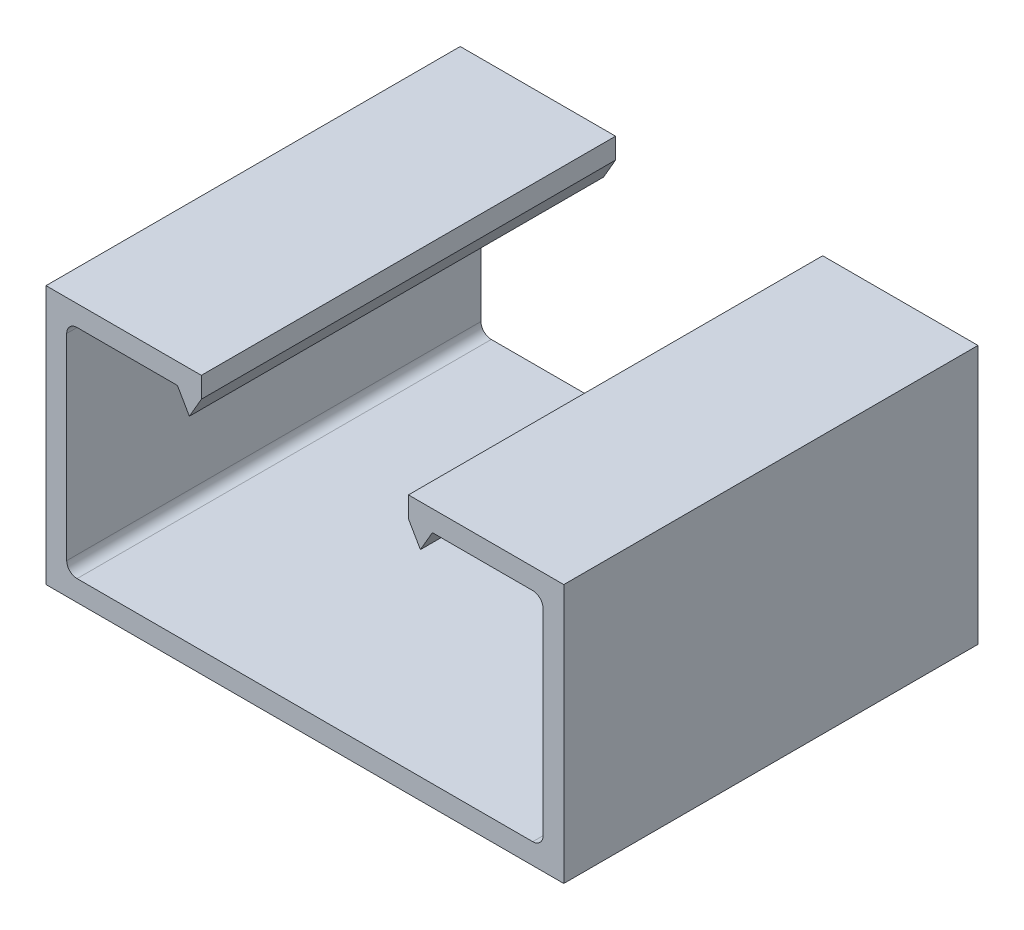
ISO-10303-21;
HEADER;
FILE_DESCRIPTION(('STEP AP214'),'2;1');
FILE_NAME('part.step','',(''),(''),'','','');
FILE_SCHEMA(('AUTOMOTIVE_DESIGN { 1 0 10303 214 1 1 1 1 }'));
ENDSEC;
DATA;
#1=APPLICATION_CONTEXT('core data for automotive mechanical design processes');
#2=APPLICATION_PROTOCOL_DEFINITION('international standard','automotive_design',2000,#1);
#3=PRODUCT_CONTEXT('',#1,'mechanical');
#4=PRODUCT('Part','Part','',(#3));
#5=PRODUCT_RELATED_PRODUCT_CATEGORY('part','',(#4));
#6=PRODUCT_DEFINITION_FORMATION('','',#4);
#7=PRODUCT_DEFINITION_CONTEXT('part definition',#1,'design');
#8=PRODUCT_DEFINITION('design','',#6,#7);
#9=PRODUCT_DEFINITION_SHAPE('','',#8);
#10=(LENGTH_UNIT() NAMED_UNIT(*) SI_UNIT(.MILLI.,.METRE.));
#11=(NAMED_UNIT(*) PLANE_ANGLE_UNIT() SI_UNIT($,.RADIAN.));
#12=(NAMED_UNIT(*) SI_UNIT($,.STERADIAN.) SOLID_ANGLE_UNIT());
#13=UNCERTAINTY_MEASURE_WITH_UNIT(LENGTH_MEASURE(1.E-05),#10,'distance_accuracy_value','');
#14=(GEOMETRIC_REPRESENTATION_CONTEXT(3) GLOBAL_UNCERTAINTY_ASSIGNED_CONTEXT((#13)) GLOBAL_UNIT_ASSIGNED_CONTEXT((#10,
#11,#12)) REPRESENTATION_CONTEXT('',''));
#15=CARTESIAN_POINT('',(0.,0.,0.));
#16=DIRECTION('',(0.,0.,1.));
#17=DIRECTION('',(1.,0.,0.));
#18=AXIS2_PLACEMENT_3D('',#15,#16,#17);
#19=CARTESIAN_POINT('',(-13.97,-6.0325,12.7));
#20=DIRECTION('',(0.,0.,-1.));
#21=DIRECTION('',(-1.,0.,0.));
#22=AXIS2_PLACEMENT_3D('',#19,#20,#21);
#23=CYLINDRICAL_SURFACE('',#22,0.635);
#24=CARTESIAN_POINT('',(-13.97,-6.0325,-12.7));
#25=DIRECTION('',(0.,0.,-1.));
#26=DIRECTION('',(1.,0.,0.));
#27=AXIS2_PLACEMENT_3D('',#24,#25,#26);
#28=CIRCLE('',#27,0.635);
#29=CARTESIAN_POINT('',(-13.97,-6.6675,-12.7));
#30=VERTEX_POINT('',#29);
#31=CARTESIAN_POINT('',(-14.605,-6.0325,-12.7));
#32=VERTEX_POINT('',#31);
#33=EDGE_CURVE('E207',#30,#32,#28,.T.);
#34=ORIENTED_EDGE('',*,*,#33,.T.);
#35=DIRECTION('',(0.,0.,-1.));
#36=VECTOR('',#35,1.);
#37=CARTESIAN_POINT('',(-14.605,-6.0325,12.7));
#38=LINE('',#37,#36);
#39=CARTESIAN_POINT('',(-14.605,-6.0325,12.7));
#40=VERTEX_POINT('',#39);
#41=EDGE_CURVE('E11',#40,#32,#38,.T.);
#42=ORIENTED_EDGE('',*,*,#41,.F.);
#43=CARTESIAN_POINT('',(-13.97,-6.0325,12.7));
#44=DIRECTION('',(0.,0.,-1.));
#45=DIRECTION('',(1.,0.,0.));
#46=AXIS2_PLACEMENT_3D('',#43,#44,#45);
#47=CIRCLE('',#46,0.635);
#48=CARTESIAN_POINT('',(-13.97,-6.6675,12.7));
#49=VERTEX_POINT('',#48);
#50=EDGE_CURVE('E245',#49,#40,#47,.T.);
#51=ORIENTED_EDGE('',*,*,#50,.F.);
#52=DIRECTION('',(0.,0.,-1.));
#53=VECTOR('',#52,1.);
#54=CARTESIAN_POINT('',(-13.97,-6.6675,12.7));
#55=LINE('',#54,#53);
#56=EDGE_CURVE('E203',#49,#30,#55,.T.);
#57=ORIENTED_EDGE('',*,*,#56,.T.);
#58=EDGE_LOOP('',(#34,#42,#51,#57));
#59=FACE_BOUND('',#58,.T.);
#60=ADVANCED_FACE('F39',(#59),#23,.F.);
#61=CARTESIAN_POINT('',(-14.605,6.0325,12.7));
#62=DIRECTION('',(-1.,0.,0.));
#63=DIRECTION('',(0.,-1.,0.));
#64=AXIS2_PLACEMENT_3D('',#61,#62,#63);
#65=PLANE('',#64);
#66=DIRECTION('',(0.,1.,0.));
#67=VECTOR('',#66,1.);
#68=CARTESIAN_POINT('',(-14.605,6.0325,-12.7));
#69=LINE('',#68,#67);
#70=CARTESIAN_POINT('',(-14.605,6.0325,-12.7));
#71=VERTEX_POINT('',#70);
#72=EDGE_CURVE('E210',#32,#71,#69,.T.);
#73=ORIENTED_EDGE('',*,*,#72,.T.);
#74=DIRECTION('',(0.,0.,-1.));
#75=VECTOR('',#74,1.);
#76=CARTESIAN_POINT('',(-14.605,6.0325,12.7));
#77=LINE('',#76,#75);
#78=CARTESIAN_POINT('',(-14.605,6.0325,12.7));
#79=VERTEX_POINT('',#78);
#80=EDGE_CURVE('E47',#79,#71,#77,.T.);
#81=ORIENTED_EDGE('',*,*,#80,.F.);
#82=DIRECTION('',(0.,1.,0.));
#83=VECTOR('',#82,1.);
#84=CARTESIAN_POINT('',(-14.605,6.0325,12.7));
#85=LINE('',#84,#83);
#86=EDGE_CURVE('E134',#40,#79,#85,.T.);
#87=ORIENTED_EDGE('',*,*,#86,.F.);
#88=ORIENTED_EDGE('',*,*,#41,.T.);
#89=EDGE_LOOP('',(#73,#81,#87,#88));
#90=FACE_BOUND('',#89,.T.);
#91=ADVANCED_FACE('F363',(#90),#65,.F.);
#92=CARTESIAN_POINT('',(-13.97,6.0325,12.7));
#93=DIRECTION('',(0.,0.,-1.));
#94=DIRECTION('',(-1.,0.,0.));
#95=AXIS2_PLACEMENT_3D('',#92,#93,#94);
#96=CYLINDRICAL_SURFACE('',#95,0.634999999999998);
#97=CARTESIAN_POINT('',(-13.97,6.0325,-12.7));
#98=DIRECTION('',(0.,0.,-1.));
#99=DIRECTION('',(1.,0.,0.));
#100=AXIS2_PLACEMENT_3D('',#97,#98,#99);
#101=CIRCLE('',#100,0.634999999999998);
#102=CARTESIAN_POINT('',(-13.97,6.6675,-12.7));
#103=VERTEX_POINT('',#102);
#104=EDGE_CURVE('E212',#71,#103,#101,.T.);
#105=ORIENTED_EDGE('',*,*,#104,.T.);
#106=DIRECTION('',(0.,0.,-1.));
#107=VECTOR('',#106,1.);
#108=CARTESIAN_POINT('',(-13.97,6.6675,12.7));
#109=LINE('',#108,#107);
#110=CARTESIAN_POINT('',(-13.97,6.6675,12.7));
#111=VERTEX_POINT('',#110);
#112=EDGE_CURVE('E288',#111,#103,#109,.T.);
#113=ORIENTED_EDGE('',*,*,#112,.F.);
#114=CARTESIAN_POINT('',(-13.97,6.0325,12.7));
#115=DIRECTION('',(0.,0.,-1.));
#116=DIRECTION('',(1.,0.,0.));
#117=AXIS2_PLACEMENT_3D('',#114,#115,#116);
#118=CIRCLE('',#117,0.634999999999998);
#119=EDGE_CURVE('E296',#79,#111,#118,.T.);
#120=ORIENTED_EDGE('',*,*,#119,.F.);
#121=ORIENTED_EDGE('',*,*,#80,.T.);
#122=EDGE_LOOP('',(#105,#113,#120,#121));
#123=FACE_BOUND('',#122,.T.);
#124=ADVANCED_FACE('F294',(#123),#96,.F.);
#125=CARTESIAN_POINT('',(-7.81646968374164,6.6675,12.7));
#126=DIRECTION('',(0.,1.,0.));
#127=DIRECTION('',(-1.,0.,0.));
#128=AXIS2_PLACEMENT_3D('',#125,#126,#127);
#129=PLANE('',#128);
#130=DIRECTION('',(1.,0.,0.));
#131=VECTOR('',#130,1.);
#132=CARTESIAN_POINT('',(-7.81646968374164,6.6675,-12.7));
#133=LINE('',#132,#131);
#134=CARTESIAN_POINT('',(-7.81646968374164,6.6675,-12.7));
#135=VERTEX_POINT('',#134);
#136=EDGE_CURVE('E214',#103,#135,#133,.T.);
#137=ORIENTED_EDGE('',*,*,#136,.T.);
#138=DIRECTION('',(0.,0.,-1.));
#139=VECTOR('',#138,1.);
#140=CARTESIAN_POINT('',(-7.81646968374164,6.6675,12.7));
#141=LINE('',#140,#139);
#142=CARTESIAN_POINT('',(-7.81646968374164,6.6675,12.7));
#143=VERTEX_POINT('',#142);
#144=EDGE_CURVE('E285',#143,#135,#141,.T.);
#145=ORIENTED_EDGE('',*,*,#144,.F.);
#146=DIRECTION('',(1.,0.,0.));
#147=VECTOR('',#146,1.);
#148=CARTESIAN_POINT('',(-7.81646968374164,6.6675,12.7));
#149=LINE('',#148,#147);
#150=EDGE_CURVE('E314',#111,#143,#149,.T.);
#151=ORIENTED_EDGE('',*,*,#150,.F.);
#152=ORIENTED_EDGE('',*,*,#112,.T.);
#153=EDGE_LOOP('',(#137,#145,#151,#152));
#154=FACE_BOUND('',#153,.T.);
#155=ADVANCED_FACE('F305',(#154),#129,.F.);
#156=CARTESIAN_POINT('',(-7.81646968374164,6.6675,12.7));
#157=DIRECTION('',(0.866025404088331,0.499999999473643,0.));
#158=DIRECTION('',(-0.499999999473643,0.866025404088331,0.));
#159=AXIS2_PLACEMENT_3D('',#156,#157,#158);
#160=PLANE('',#159);
#161=DIRECTION('',(0.499999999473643,-0.866025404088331,0.));
#162=VECTOR('',#161,1.);
#163=CARTESIAN_POINT('',(-7.81646968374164,6.6675,-12.7));
#164=LINE('',#163,#162);
#165=CARTESIAN_POINT('',(-7.0832348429,5.3975,-12.7));
#166=VERTEX_POINT('',#165);
#167=EDGE_CURVE('E216',#135,#166,#164,.T.);
#168=ORIENTED_EDGE('',*,*,#167,.T.);
#169=DIRECTION('',(0.,0.,-1.));
#170=VECTOR('',#169,1.);
#171=CARTESIAN_POINT('',(-7.0832348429,5.3975,12.7));
#172=LINE('',#171,#170);
#173=CARTESIAN_POINT('',(-7.0832348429,5.3975,12.7));
#174=VERTEX_POINT('',#173);
#175=EDGE_CURVE('E282',#174,#166,#172,.T.);
#176=ORIENTED_EDGE('',*,*,#175,.F.);
#177=DIRECTION('',(0.499999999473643,-0.866025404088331,0.));
#178=VECTOR('',#177,1.);
#179=CARTESIAN_POINT('',(-7.81646968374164,6.6675,12.7));
#180=LINE('',#179,#178);
#181=EDGE_CURVE('E311',#143,#174,#180,.T.);
#182=ORIENTED_EDGE('',*,*,#181,.F.);
#183=ORIENTED_EDGE('',*,*,#144,.T.);
#184=EDGE_LOOP('',(#168,#176,#182,#183));
#185=FACE_BOUND('',#184,.T.);
#186=ADVANCED_FACE('F309',(#185),#160,.F.);
#187=CARTESIAN_POINT('',(-7.0832348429,5.3975,12.7));
#188=DIRECTION('',(-0.86602540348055,0.500000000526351,0.));
#189=DIRECTION('',(-0.500000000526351,-0.86602540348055,0.));
#190=AXIS2_PLACEMENT_3D('',#187,#188,#189);
#191=PLANE('',#190);
#192=DIRECTION('',(0.500000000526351,0.86602540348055,0.));
#193=VECTOR('',#192,1.);
#194=CARTESIAN_POINT('',(-7.0832348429,5.3975,-12.7));
#195=LINE('',#194,#193);
#196=CARTESIAN_POINT('',(-6.35,6.6675,-12.7));
#197=VERTEX_POINT('',#196);
#198=EDGE_CURVE('E218',#166,#197,#195,.T.);
#199=ORIENTED_EDGE('',*,*,#198,.T.);
#200=DIRECTION('',(0.,0.,-1.));
#201=VECTOR('',#200,1.);
#202=CARTESIAN_POINT('',(-6.35,6.6675,12.7));
#203=LINE('',#202,#201);
#204=CARTESIAN_POINT('',(-6.35,6.6675,12.7));
#205=VERTEX_POINT('',#204);
#206=EDGE_CURVE('E279',#205,#197,#203,.T.);
#207=ORIENTED_EDGE('',*,*,#206,.F.);
#208=DIRECTION('',(0.500000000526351,0.86602540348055,0.));
#209=VECTOR('',#208,1.);
#210=CARTESIAN_POINT('',(-7.0832348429,5.3975,12.7));
#211=LINE('',#210,#209);
#212=EDGE_CURVE('E313',#174,#205,#211,.T.);
#213=ORIENTED_EDGE('',*,*,#212,.F.);
#214=ORIENTED_EDGE('',*,*,#175,.T.);
#215=EDGE_LOOP('',(#199,#207,#213,#214));
#216=FACE_BOUND('',#215,.T.);
#217=ADVANCED_FACE('F376',(#216),#191,.F.);
#218=CARTESIAN_POINT('',(-6.35,6.6675,12.7));
#219=DIRECTION('',(-1.,0.,0.));
#220=DIRECTION('',(0.,-1.,0.));
#221=AXIS2_PLACEMENT_3D('',#218,#219,#220);
#222=PLANE('',#221);
#223=DIRECTION('',(0.,1.,0.));
#224=VECTOR('',#223,1.);
#225=CARTESIAN_POINT('',(-6.35,6.6675,-12.7));
#226=LINE('',#225,#224);
#227=CARTESIAN_POINT('',(-6.35,7.9375,-12.7));
#228=VERTEX_POINT('',#227);
#229=EDGE_CURVE('E220',#197,#228,#226,.T.);
#230=ORIENTED_EDGE('',*,*,#229,.T.);
#231=DIRECTION('',(0.,0.,-1.));
#232=VECTOR('',#231,1.);
#233=CARTESIAN_POINT('',(-6.35,7.9375,12.7));
#234=LINE('',#233,#232);
#235=CARTESIAN_POINT('',(-6.35,7.9375,12.7));
#236=VERTEX_POINT('',#235);
#237=EDGE_CURVE('E276',#236,#228,#234,.T.);
#238=ORIENTED_EDGE('',*,*,#237,.F.);
#239=DIRECTION('',(0.,1.,0.));
#240=VECTOR('',#239,1.);
#241=CARTESIAN_POINT('',(-6.35,6.6675,12.7));
#242=LINE('',#241,#240);
#243=EDGE_CURVE('E316',#205,#236,#242,.T.);
#244=ORIENTED_EDGE('',*,*,#243,.F.);
#245=ORIENTED_EDGE('',*,*,#206,.T.);
#246=EDGE_LOOP('',(#230,#238,#244,#245));
#247=FACE_BOUND('',#246,.T.);
#248=ADVANCED_FACE('F379',(#247),#222,.F.);
#249=CARTESIAN_POINT('',(-6.35,7.9375,12.7));
#250=DIRECTION('',(0.,-1.,0.));
#251=DIRECTION('',(1.,0.,0.));
#252=AXIS2_PLACEMENT_3D('',#249,#250,#251);
#253=PLANE('',#252);
#254=DIRECTION('',(-1.,0.,0.));
#255=VECTOR('',#254,1.);
#256=CARTESIAN_POINT('',(-6.35,7.9375,-12.7));
#257=LINE('',#256,#255);
#258=CARTESIAN_POINT('',(-15.875,7.9375,-12.7));
#259=VERTEX_POINT('',#258);
#260=EDGE_CURVE('E222',#228,#259,#257,.T.);
#261=ORIENTED_EDGE('',*,*,#260,.T.);
#262=DIRECTION('',(0.,0.,-1.));
#263=VECTOR('',#262,1.);
#264=CARTESIAN_POINT('',(-15.875,7.9375,12.7));
#265=LINE('',#264,#263);
#266=CARTESIAN_POINT('',(-15.875,7.9375,12.7));
#267=VERTEX_POINT('',#266);
#268=EDGE_CURVE('E273',#267,#259,#265,.T.);
#269=ORIENTED_EDGE('',*,*,#268,.F.);
#270=DIRECTION('',(-1.,0.,0.));
#271=VECTOR('',#270,1.);
#272=CARTESIAN_POINT('',(-6.35,7.9375,12.7));
#273=LINE('',#272,#271);
#274=EDGE_CURVE('E322',#236,#267,#273,.T.);
#275=ORIENTED_EDGE('',*,*,#274,.F.);
#276=ORIENTED_EDGE('',*,*,#237,.T.);
#277=EDGE_LOOP('',(#261,#269,#275,#276));
#278=FACE_BOUND('',#277,.T.);
#279=ADVANCED_FACE('F383',(#278),#253,.F.);
#280=CARTESIAN_POINT('',(-15.875,7.9375,12.7));
#281=DIRECTION('',(1.,0.,0.));
#282=DIRECTION('',(0.,1.,0.));
#283=AXIS2_PLACEMENT_3D('',#280,#281,#282);
#284=PLANE('',#283);
#285=DIRECTION('',(0.,-1.,0.));
#286=VECTOR('',#285,1.);
#287=CARTESIAN_POINT('',(-15.875,7.9375,-12.7));
#288=LINE('',#287,#286);
#289=CARTESIAN_POINT('',(-15.875,-7.9375,-12.7));
#290=VERTEX_POINT('',#289);
#291=EDGE_CURVE('E224',#259,#290,#288,.T.);
#292=ORIENTED_EDGE('',*,*,#291,.T.);
#293=DIRECTION('',(0.,0.,-1.));
#294=VECTOR('',#293,1.);
#295=CARTESIAN_POINT('',(-15.875,-7.9375,12.7));
#296=LINE('',#295,#294);
#297=CARTESIAN_POINT('',(-15.875,-7.9375,12.7));
#298=VERTEX_POINT('',#297);
#299=EDGE_CURVE('E270',#298,#290,#296,.T.);
#300=ORIENTED_EDGE('',*,*,#299,.F.);
#301=DIRECTION('',(0.,-1.,0.));
#302=VECTOR('',#301,1.);
#303=CARTESIAN_POINT('',(-15.875,7.9375,12.7));
#304=LINE('',#303,#302);
#305=EDGE_CURVE('E324',#267,#298,#304,.T.);
#306=ORIENTED_EDGE('',*,*,#305,.F.);
#307=ORIENTED_EDGE('',*,*,#268,.T.);
#308=EDGE_LOOP('',(#292,#300,#306,#307));
#309=FACE_BOUND('',#308,.T.);
#310=ADVANCED_FACE('F387',(#309),#284,.F.);
#311=CARTESIAN_POINT('',(-15.875,-7.9375,12.7));
#312=DIRECTION('',(0.,1.,0.));
#313=DIRECTION('',(0.,0.,1.));
#314=AXIS2_PLACEMENT_3D('',#311,#312,#313);
#315=PLANE('',#314);
#316=DIRECTION('',(1.,0.,0.));
#317=VECTOR('',#316,1.);
#318=CARTESIAN_POINT('',(-15.875,-7.9375,-12.7));
#319=LINE('',#318,#317);
#320=CARTESIAN_POINT('',(15.875,-7.9375,-12.7));
#321=VERTEX_POINT('',#320);
#322=EDGE_CURVE('E226',#290,#321,#319,.T.);
#323=ORIENTED_EDGE('',*,*,#322,.T.);
#324=DIRECTION('',(0.,0.,-1.));
#325=VECTOR('',#324,1.);
#326=CARTESIAN_POINT('',(15.875,-7.9375,12.7));
#327=LINE('',#326,#325);
#328=CARTESIAN_POINT('',(15.875,-7.9375,12.7));
#329=VERTEX_POINT('',#328);
#330=EDGE_CURVE('E267',#329,#321,#327,.T.);
#331=ORIENTED_EDGE('',*,*,#330,.F.);
#332=DIRECTION('',(1.,0.,0.));
#333=VECTOR('',#332,1.);
#334=CARTESIAN_POINT('',(-15.875,-7.9375,12.7));
#335=LINE('',#334,#333);
#336=EDGE_CURVE('E326',#298,#329,#335,.T.);
#337=ORIENTED_EDGE('',*,*,#336,.F.);
#338=ORIENTED_EDGE('',*,*,#299,.T.);
#339=EDGE_LOOP('',(#323,#331,#337,#338));
#340=FACE_BOUND('',#339,.T.);
#341=ADVANCED_FACE('F391',(#340),#315,.F.);
#342=CARTESIAN_POINT('',(15.875,-7.9375,12.7));
#343=DIRECTION('',(-1.,0.,0.));
#344=DIRECTION('',(0.,0.,1.));
#345=AXIS2_PLACEMENT_3D('',#342,#343,#344);
#346=PLANE('',#345);
#347=DIRECTION('',(0.,1.,0.));
#348=VECTOR('',#347,1.);
#349=CARTESIAN_POINT('',(15.875,-7.9375,-12.7));
#350=LINE('',#349,#348);
#351=CARTESIAN_POINT('',(15.875,7.9375,-12.7));
#352=VERTEX_POINT('',#351);
#353=EDGE_CURVE('E228',#321,#352,#350,.T.);
#354=ORIENTED_EDGE('',*,*,#353,.T.);
#355=DIRECTION('',(0.,0.,-1.));
#356=VECTOR('',#355,1.);
#357=CARTESIAN_POINT('',(15.875,7.9375,12.7));
#358=LINE('',#357,#356);
#359=CARTESIAN_POINT('',(15.875,7.9375,12.7));
#360=VERTEX_POINT('',#359);
#361=EDGE_CURVE('E264',#360,#352,#358,.T.);
#362=ORIENTED_EDGE('',*,*,#361,.F.);
#363=DIRECTION('',(0.,1.,0.));
#364=VECTOR('',#363,1.);
#365=CARTESIAN_POINT('',(15.875,-7.9375,12.7));
#366=LINE('',#365,#364);
#367=EDGE_CURVE('E328',#329,#360,#366,.T.);
#368=ORIENTED_EDGE('',*,*,#367,.F.);
#369=ORIENTED_EDGE('',*,*,#330,.T.);
#370=EDGE_LOOP('',(#354,#362,#368,#369));
#371=FACE_BOUND('',#370,.T.);
#372=ADVANCED_FACE('F395',(#371),#346,.F.);
#373=CARTESIAN_POINT('',(15.875,7.9375,12.7));
#374=DIRECTION('',(0.,-1.,0.));
#375=DIRECTION('',(0.,0.,-1.));
#376=AXIS2_PLACEMENT_3D('',#373,#374,#375);
#377=PLANE('',#376);
#378=DIRECTION('',(-1.,0.,0.));
#379=VECTOR('',#378,1.);
#380=CARTESIAN_POINT('',(15.875,7.9375,-12.7));
#381=LINE('',#380,#379);
#382=CARTESIAN_POINT('',(6.34999999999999,7.9375,-12.7));
#383=VERTEX_POINT('',#382);
#384=EDGE_CURVE('E230',#352,#383,#381,.T.);
#385=ORIENTED_EDGE('',*,*,#384,.T.);
#386=DIRECTION('',(0.,0.,-1.));
#387=VECTOR('',#386,1.);
#388=CARTESIAN_POINT('',(6.34999999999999,7.9375,12.7));
#389=LINE('',#388,#387);
#390=CARTESIAN_POINT('',(6.34999999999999,7.9375,12.7));
#391=VERTEX_POINT('',#390);
#392=EDGE_CURVE('E261',#391,#383,#389,.T.);
#393=ORIENTED_EDGE('',*,*,#392,.F.);
#394=DIRECTION('',(-1.,0.,0.));
#395=VECTOR('',#394,1.);
#396=CARTESIAN_POINT('',(15.875,7.9375,12.7));
#397=LINE('',#396,#395);
#398=EDGE_CURVE('E330',#360,#391,#397,.T.);
#399=ORIENTED_EDGE('',*,*,#398,.F.);
#400=ORIENTED_EDGE('',*,*,#361,.T.);
#401=EDGE_LOOP('',(#385,#393,#399,#400));
#402=FACE_BOUND('',#401,.T.);
#403=ADVANCED_FACE('F399',(#402),#377,.F.);
#404=CARTESIAN_POINT('',(6.34999999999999,6.6675,12.7));
#405=DIRECTION('',(1.,0.,0.));
#406=DIRECTION('',(0.,0.,-1.));
#407=AXIS2_PLACEMENT_3D('',#404,#405,#406);
#408=PLANE('',#407);
#409=DIRECTION('',(0.,-1.,0.));
#410=VECTOR('',#409,1.);
#411=CARTESIAN_POINT('',(6.34999999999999,6.6675,-12.7));
#412=LINE('',#411,#410);
#413=CARTESIAN_POINT('',(6.34999999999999,6.6675,-12.7));
#414=VERTEX_POINT('',#413);
#415=EDGE_CURVE('E232',#383,#414,#412,.T.);
#416=ORIENTED_EDGE('',*,*,#415,.T.);
#417=DIRECTION('',(0.,0.,-1.));
#418=VECTOR('',#417,1.);
#419=CARTESIAN_POINT('',(6.34999999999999,6.6675,12.7));
#420=LINE('',#419,#418);
#421=CARTESIAN_POINT('',(6.34999999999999,6.6675,12.7));
#422=VERTEX_POINT('',#421);
#423=EDGE_CURVE('E258',#422,#414,#420,.T.);
#424=ORIENTED_EDGE('',*,*,#423,.F.);
#425=DIRECTION('',(0.,-1.,0.));
#426=VECTOR('',#425,1.);
#427=CARTESIAN_POINT('',(6.34999999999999,6.6675,12.7));
#428=LINE('',#427,#426);
#429=EDGE_CURVE('E332',#391,#422,#428,.T.);
#430=ORIENTED_EDGE('',*,*,#429,.F.);
#431=ORIENTED_EDGE('',*,*,#392,.T.);
#432=EDGE_LOOP('',(#416,#424,#430,#431));
#433=FACE_BOUND('',#432,.T.);
#434=ADVANCED_FACE('F403',(#433),#408,.F.);
#435=CARTESIAN_POINT('',(7.0832348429,5.3975,12.7));
#436=DIRECTION('',(0.866025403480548,0.500000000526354,0.));
#437=DIRECTION('',(-0.500000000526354,0.866025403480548,0.));
#438=AXIS2_PLACEMENT_3D('',#435,#436,#437);
#439=PLANE('',#438);
#440=DIRECTION('',(0.500000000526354,-0.866025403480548,0.));
#441=VECTOR('',#440,1.);
#442=CARTESIAN_POINT('',(7.0832348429,5.3975,-12.7));
#443=LINE('',#442,#441);
#444=CARTESIAN_POINT('',(7.0832348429,5.3975,-12.7));
#445=VERTEX_POINT('',#444);
#446=EDGE_CURVE('E234',#414,#445,#443,.T.);
#447=ORIENTED_EDGE('',*,*,#446,.T.);
#448=DIRECTION('',(0.,0.,-1.));
#449=VECTOR('',#448,1.);
#450=CARTESIAN_POINT('',(7.0832348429,5.3975,12.7));
#451=LINE('',#450,#449);
#452=CARTESIAN_POINT('',(7.0832348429,5.3975,12.7));
#453=VERTEX_POINT('',#452);
#454=EDGE_CURVE('E255',#453,#445,#451,.T.);
#455=ORIENTED_EDGE('',*,*,#454,.F.);
#456=DIRECTION('',(0.500000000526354,-0.866025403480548,0.));
#457=VECTOR('',#456,1.);
#458=CARTESIAN_POINT('',(7.0832348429,5.3975,12.7));
#459=LINE('',#458,#457);
#460=EDGE_CURVE('E334',#422,#453,#459,.T.);
#461=ORIENTED_EDGE('',*,*,#460,.F.);
#462=ORIENTED_EDGE('',*,*,#423,.T.);
#463=EDGE_LOOP('',(#447,#455,#461,#462));
#464=FACE_BOUND('',#463,.T.);
#465=ADVANCED_FACE('F407',(#464),#439,.F.);
#466=CARTESIAN_POINT('',(7.81646968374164,6.6675,12.7));
#467=DIRECTION('',(-0.866025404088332,0.499999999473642,0.));
#468=DIRECTION('',(-0.499999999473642,-0.866025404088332,0.));
#469=AXIS2_PLACEMENT_3D('',#466,#467,#468);
#470=PLANE('',#469);
#471=DIRECTION('',(0.499999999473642,0.866025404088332,0.));
#472=VECTOR('',#471,1.);
#473=CARTESIAN_POINT('',(7.81646968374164,6.6675,-12.7));
#474=LINE('',#473,#472);
#475=CARTESIAN_POINT('',(7.81646968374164,6.6675,-12.7));
#476=VERTEX_POINT('',#475);
#477=EDGE_CURVE('E236',#445,#476,#474,.T.);
#478=ORIENTED_EDGE('',*,*,#477,.T.);
#479=DIRECTION('',(0.,0.,-1.));
#480=VECTOR('',#479,1.);
#481=CARTESIAN_POINT('',(7.81646968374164,6.6675,12.7));
#482=LINE('',#481,#480);
#483=CARTESIAN_POINT('',(7.81646968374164,6.6675,12.7));
#484=VERTEX_POINT('',#483);
#485=EDGE_CURVE('E252',#484,#476,#482,.T.);
#486=ORIENTED_EDGE('',*,*,#485,.F.);
#487=DIRECTION('',(0.499999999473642,0.866025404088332,0.));
#488=VECTOR('',#487,1.);
#489=CARTESIAN_POINT('',(7.81646968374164,6.6675,12.7));
#490=LINE('',#489,#488);
#491=EDGE_CURVE('E336',#453,#484,#490,.T.);
#492=ORIENTED_EDGE('',*,*,#491,.F.);
#493=ORIENTED_EDGE('',*,*,#454,.T.);
#494=EDGE_LOOP('',(#478,#486,#492,#493));
#495=FACE_BOUND('',#494,.T.);
#496=ADVANCED_FACE('F411',(#495),#470,.F.);
#497=CARTESIAN_POINT('',(13.97,6.6675,12.7));
#498=DIRECTION('',(0.,1.,0.));
#499=DIRECTION('',(-1.,0.,0.));
#500=AXIS2_PLACEMENT_3D('',#497,#498,#499);
#501=PLANE('',#500);
#502=DIRECTION('',(1.,0.,0.));
#503=VECTOR('',#502,1.);
#504=CARTESIAN_POINT('',(13.97,6.6675,-12.7));
#505=LINE('',#504,#503);
#506=CARTESIAN_POINT('',(13.97,6.6675,-12.7));
#507=VERTEX_POINT('',#506);
#508=EDGE_CURVE('E238',#476,#507,#505,.T.);
#509=ORIENTED_EDGE('',*,*,#508,.T.);
#510=DIRECTION('',(0.,0.,-1.));
#511=VECTOR('',#510,1.);
#512=CARTESIAN_POINT('',(13.97,6.6675,12.7));
#513=LINE('',#512,#511);
#514=CARTESIAN_POINT('',(13.97,6.6675,12.7));
#515=VERTEX_POINT('',#514);
#516=EDGE_CURVE('E249',#515,#507,#513,.T.);
#517=ORIENTED_EDGE('',*,*,#516,.F.);
#518=DIRECTION('',(1.,0.,0.));
#519=VECTOR('',#518,1.);
#520=CARTESIAN_POINT('',(13.97,6.6675,12.7));
#521=LINE('',#520,#519);
#522=EDGE_CURVE('E338',#484,#515,#521,.T.);
#523=ORIENTED_EDGE('',*,*,#522,.F.);
#524=ORIENTED_EDGE('',*,*,#485,.T.);
#525=EDGE_LOOP('',(#509,#517,#523,#524));
#526=FACE_BOUND('',#525,.T.);
#527=ADVANCED_FACE('F344',(#526),#501,.F.);
#528=CARTESIAN_POINT('',(13.97,6.0325,12.7));
#529=DIRECTION('',(0.,0.,-1.));
#530=DIRECTION('',(-1.,0.,0.));
#531=AXIS2_PLACEMENT_3D('',#528,#529,#530);
#532=CYLINDRICAL_SURFACE('',#531,0.635000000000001);
#533=CARTESIAN_POINT('',(13.97,6.0325,-12.7));
#534=DIRECTION('',(0.,0.,-1.));
#535=DIRECTION('',(1.,0.,0.));
#536=AXIS2_PLACEMENT_3D('',#533,#534,#535);
#537=CIRCLE('',#536,0.635000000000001);
#538=CARTESIAN_POINT('',(14.605,6.0325,-12.7));
#539=VERTEX_POINT('',#538);
#540=EDGE_CURVE('E240',#507,#539,#537,.T.);
#541=ORIENTED_EDGE('',*,*,#540,.T.);
#542=DIRECTION('',(0.,0.,-1.));
#543=VECTOR('',#542,1.);
#544=CARTESIAN_POINT('',(14.605,6.0325,12.7));
#545=LINE('',#544,#543);
#546=CARTESIAN_POINT('',(14.605,6.0325,12.7));
#547=VERTEX_POINT('',#546);
#548=EDGE_CURVE('E198',#547,#539,#545,.T.);
#549=ORIENTED_EDGE('',*,*,#548,.F.);
#550=CARTESIAN_POINT('',(13.97,6.0325,12.7));
#551=DIRECTION('',(0.,0.,-1.));
#552=DIRECTION('',(1.,0.,0.));
#553=AXIS2_PLACEMENT_3D('',#550,#551,#552);
#554=CIRCLE('',#553,0.635000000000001);
#555=EDGE_CURVE('E189',#515,#547,#554,.T.);
#556=ORIENTED_EDGE('',*,*,#555,.F.);
#557=ORIENTED_EDGE('',*,*,#516,.T.);
#558=EDGE_LOOP('',(#541,#549,#556,#557));
#559=FACE_BOUND('',#558,.T.);
#560=ADVANCED_FACE('F348',(#559),#532,.F.);
#561=CARTESIAN_POINT('',(14.605,-6.0325,12.7));
#562=DIRECTION('',(1.,0.,0.));
#563=DIRECTION('',(0.,1.,0.));
#564=AXIS2_PLACEMENT_3D('',#561,#562,#563);
#565=PLANE('',#564);
#566=DIRECTION('',(0.,-1.,0.));
#567=VECTOR('',#566,1.);
#568=CARTESIAN_POINT('',(14.605,-6.0325,-12.7));
#569=LINE('',#568,#567);
#570=CARTESIAN_POINT('',(14.605,-6.0325,-12.7));
#571=VERTEX_POINT('',#570);
#572=EDGE_CURVE('E197',#539,#571,#569,.T.);
#573=ORIENTED_EDGE('',*,*,#572,.T.);
#574=DIRECTION('',(0.,0.,-1.));
#575=VECTOR('',#574,1.);
#576=CARTESIAN_POINT('',(14.605,-6.0325,12.7));
#577=LINE('',#576,#575);
#578=CARTESIAN_POINT('',(14.605,-6.0325,12.7));
#579=VERTEX_POINT('',#578);
#580=EDGE_CURVE('E194',#579,#571,#577,.T.);
#581=ORIENTED_EDGE('',*,*,#580,.F.);
#582=DIRECTION('',(0.,-1.,0.));
#583=VECTOR('',#582,1.);
#584=CARTESIAN_POINT('',(14.605,-6.0325,12.7));
#585=LINE('',#584,#583);
#586=EDGE_CURVE('E183',#547,#579,#585,.T.);
#587=ORIENTED_EDGE('',*,*,#586,.F.);
#588=ORIENTED_EDGE('',*,*,#548,.T.);
#589=EDGE_LOOP('',(#573,#581,#587,#588));
#590=FACE_BOUND('',#589,.T.);
#591=ADVANCED_FACE('F195',(#590),#565,.F.);
#592=CARTESIAN_POINT('',(13.97,-6.0325,12.7));
#593=DIRECTION('',(0.,0.,-1.));
#594=DIRECTION('',(-1.,0.,0.));
#595=AXIS2_PLACEMENT_3D('',#592,#593,#594);
#596=CYLINDRICAL_SURFACE('',#595,0.635000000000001);
#597=CARTESIAN_POINT('',(13.97,-6.0325,-12.7));
#598=DIRECTION('',(0.,0.,-1.));
#599=DIRECTION('',(1.,0.,0.));
#600=AXIS2_PLACEMENT_3D('',#597,#598,#599);
#601=CIRCLE('',#600,0.635000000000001);
#602=CARTESIAN_POINT('',(13.97,-6.6675,-12.7));
#603=VERTEX_POINT('',#602);
#604=EDGE_CURVE('E120',#571,#603,#601,.T.);
#605=ORIENTED_EDGE('',*,*,#604,.T.);
#606=DIRECTION('',(0.,0.,-1.));
#607=VECTOR('',#606,1.);
#608=CARTESIAN_POINT('',(13.97,-6.6675,12.7));
#609=LINE('',#608,#607);
#610=CARTESIAN_POINT('',(13.97,-6.6675,12.7));
#611=VERTEX_POINT('',#610);
#612=EDGE_CURVE('E199',#611,#603,#609,.T.);
#613=ORIENTED_EDGE('',*,*,#612,.F.);
#614=CARTESIAN_POINT('',(13.97,-6.0325,12.7));
#615=DIRECTION('',(0.,0.,-1.));
#616=DIRECTION('',(1.,0.,0.));
#617=AXIS2_PLACEMENT_3D('',#614,#615,#616);
#618=CIRCLE('',#617,0.635000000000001);
#619=EDGE_CURVE('E187',#579,#611,#618,.T.);
#620=ORIENTED_EDGE('',*,*,#619,.F.);
#621=ORIENTED_EDGE('',*,*,#580,.T.);
#622=EDGE_LOOP('',(#605,#613,#620,#621));
#623=FACE_BOUND('',#622,.T.);
#624=ADVANCED_FACE('F201',(#623),#596,.F.);
#625=CARTESIAN_POINT('',(-13.97,-6.6675,12.7));
#626=DIRECTION('',(0.,-1.,0.));
#627=DIRECTION('',(0.,0.,-1.));
#628=AXIS2_PLACEMENT_3D('',#625,#626,#627);
#629=PLANE('',#628);
#630=DIRECTION('',(-1.,0.,0.));
#631=VECTOR('',#630,1.);
#632=CARTESIAN_POINT('',(-13.97,-6.6675,-12.7));
#633=LINE('',#632,#631);
#634=EDGE_CURVE('E126',#603,#30,#633,.T.);
#635=ORIENTED_EDGE('',*,*,#634,.T.);
#636=ORIENTED_EDGE('',*,*,#56,.F.);
#637=DIRECTION('',(-1.,0.,0.));
#638=VECTOR('',#637,1.);
#639=CARTESIAN_POINT('',(-13.97,-6.6675,12.7));
#640=LINE('',#639,#638);
#641=EDGE_CURVE('E55',#611,#49,#640,.T.);
#642=ORIENTED_EDGE('',*,*,#641,.F.);
#643=ORIENTED_EDGE('',*,*,#612,.T.);
#644=EDGE_LOOP('',(#635,#636,#642,#643));
#645=FACE_BOUND('',#644,.T.);
#646=ADVANCED_FACE('F352',(#645),#629,.F.);
#647=CARTESIAN_POINT('',(-13.97,-6.0325,12.7));
#648=DIRECTION('',(0.,0.,1.));
#649=DIRECTION('',(1.,0.,0.));
#650=AXIS2_PLACEMENT_3D('',#647,#648,#649);
#651=PLANE('',#650);
#652=ORIENTED_EDGE('',*,*,#50,.T.);
#653=ORIENTED_EDGE('',*,*,#86,.T.);
#654=ORIENTED_EDGE('',*,*,#119,.T.);
#655=ORIENTED_EDGE('',*,*,#150,.T.);
#656=ORIENTED_EDGE('',*,*,#181,.T.);
#657=ORIENTED_EDGE('',*,*,#212,.T.);
#658=ORIENTED_EDGE('',*,*,#243,.T.);
#659=ORIENTED_EDGE('',*,*,#274,.T.);
#660=ORIENTED_EDGE('',*,*,#305,.T.);
#661=ORIENTED_EDGE('',*,*,#336,.T.);
#662=ORIENTED_EDGE('',*,*,#367,.T.);
#663=ORIENTED_EDGE('',*,*,#398,.T.);
#664=ORIENTED_EDGE('',*,*,#429,.T.);
#665=ORIENTED_EDGE('',*,*,#460,.T.);
#666=ORIENTED_EDGE('',*,*,#491,.T.);
#667=ORIENTED_EDGE('',*,*,#522,.T.);
#668=ORIENTED_EDGE('',*,*,#555,.T.);
#669=ORIENTED_EDGE('',*,*,#586,.T.);
#670=ORIENTED_EDGE('',*,*,#619,.T.);
#671=ORIENTED_EDGE('',*,*,#641,.T.);
#672=EDGE_LOOP('',(#652,#653,#654,#655,#656,#657,#658,#659,#660,#661,#662,#663,#664,#665,#666,
#667,#668,#669,#670,#671));
#673=FACE_BOUND('',#672,.T.);
#674=ADVANCED_FACE('F185',(#673),#651,.T.);
#675=CARTESIAN_POINT('',(-13.97,-6.0325,-12.7));
#676=DIRECTION('',(0.,0.,1.));
#677=DIRECTION('',(1.,0.,0.));
#678=AXIS2_PLACEMENT_3D('',#675,#676,#677);
#679=PLANE('',#678);
#680=ORIENTED_EDGE('',*,*,#33,.F.);
#681=ORIENTED_EDGE('',*,*,#634,.F.);
#682=ORIENTED_EDGE('',*,*,#604,.F.);
#683=ORIENTED_EDGE('',*,*,#572,.F.);
#684=ORIENTED_EDGE('',*,*,#540,.F.);
#685=ORIENTED_EDGE('',*,*,#508,.F.);
#686=ORIENTED_EDGE('',*,*,#477,.F.);
#687=ORIENTED_EDGE('',*,*,#446,.F.);
#688=ORIENTED_EDGE('',*,*,#415,.F.);
#689=ORIENTED_EDGE('',*,*,#384,.F.);
#690=ORIENTED_EDGE('',*,*,#353,.F.);
#691=ORIENTED_EDGE('',*,*,#322,.F.);
#692=ORIENTED_EDGE('',*,*,#291,.F.);
#693=ORIENTED_EDGE('',*,*,#260,.F.);
#694=ORIENTED_EDGE('',*,*,#229,.F.);
#695=ORIENTED_EDGE('',*,*,#198,.F.);
#696=ORIENTED_EDGE('',*,*,#167,.F.);
#697=ORIENTED_EDGE('',*,*,#136,.F.);
#698=ORIENTED_EDGE('',*,*,#104,.F.);
#699=ORIENTED_EDGE('',*,*,#72,.F.);
#700=EDGE_LOOP('',(#680,#681,#682,#683,#684,#685,#686,#687,#688,#689,#690,#691,#692,#693,#694,
#695,#696,#697,#698,#699));
#701=FACE_BOUND('',#700,.T.);
#702=ADVANCED_FACE('F300',(#701),#679,.F.);
#703=CLOSED_SHELL('',(#60,#91,#124,#155,#186,#217,#248,#279,#310,#341,#372,#403,#434,#465,#496,
#527,#560,#591,#624,#646,#674,#702));
#704=MANIFOLD_SOLID_BREP('B2',#703);
#705=ADVANCED_BREP_SHAPE_REPRESENTATION('',(#18,#704),#14);
#706=SHAPE_DEFINITION_REPRESENTATION(#9,#705);
ENDSEC;
END-ISO-10303-21;
